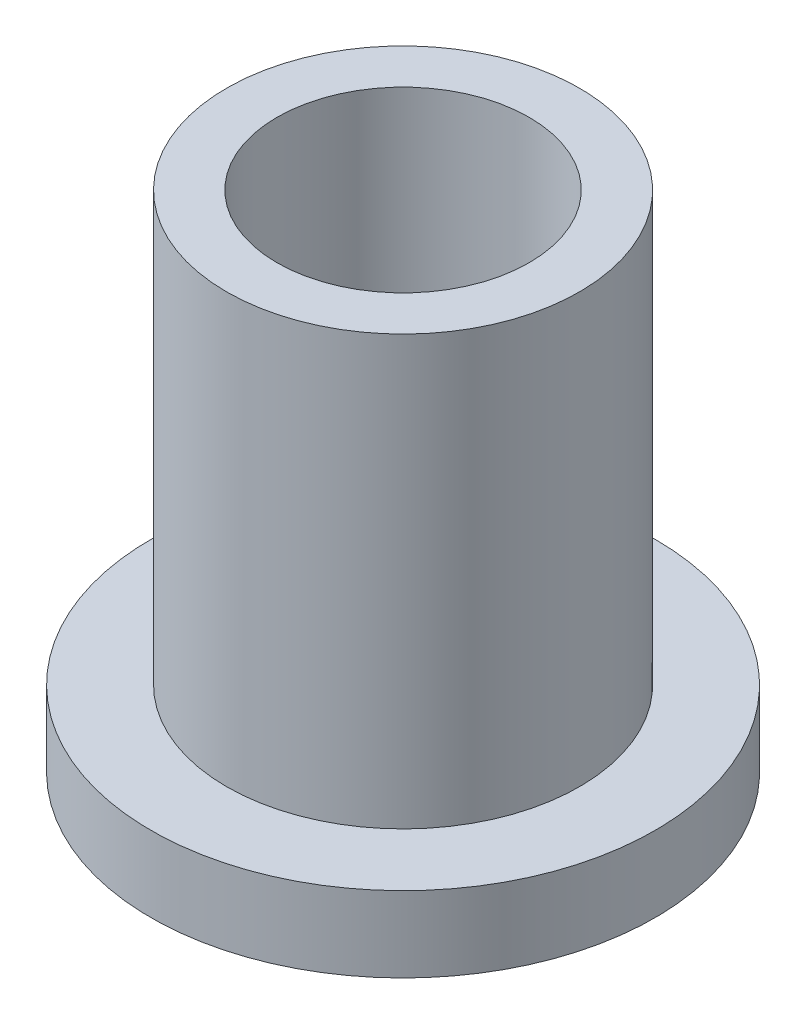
from build123d import *

# Parameters (mm, degrees)
SKETCH2_R           = 11.1125
SKETCH2_R_2         = 7.9375
BOSS_EXTRUDE1_DEPTH = 31.75
SKETCH3_R           = 15.875
SKETCH3_R_2         = 11.1125
BOSS_EXTRUDE2_DEPTH = 4.7625


with BuildPart() as part:
    # Sketch2 → Boss-Extrude1 (new body)
    with BuildSketch(Plane(origin=(0, 0, 0), x_dir=(1, 0, 0), z_dir=(0, 1, 0))):
        with Locations(Location((0, 0, 0), (0, 0, 270))):
            Circle(SKETCH2_R)
        with Locations(Location((0, 0, 0), (0, 0, 270))):
            Circle(SKETCH2_R_2, mode=Mode.SUBTRACT)
    extrude(amount=BOSS_EXTRUDE1_DEPTH)

    # Sketch3 → Boss-Extrude2 (add)
    with BuildSketch(Plane(origin=(0, 0, 0), x_dir=(1, 0, 0), z_dir=(0, 1, 0))):
        with Locations(Location((0, 0, 0), (0, 0, 90))):
            Circle(SKETCH3_R)
        with Locations(Location((0, 0, 0), (0, 0, 270))):
            Circle(SKETCH3_R_2, mode=Mode.SUBTRACT)
    extrude(amount=BOSS_EXTRUDE2_DEPTH)


solid = part.part
